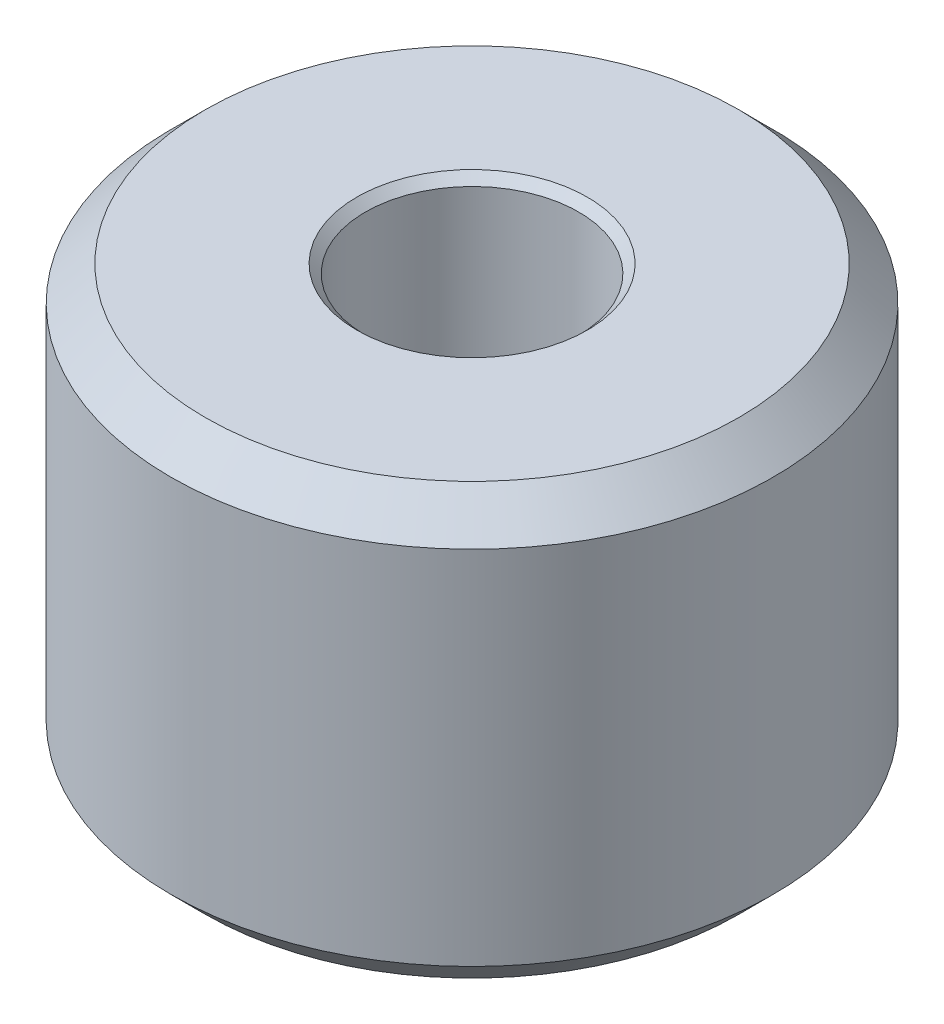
from build123d import *

# Parameters (mm, degrees)
ESQUISSE1_R             = 17.5
BOSS_EXTRU_1_DEPTH      = 25
CHANFREIN1_SIZE         = 2
ESQUISSE2_R             = 6.2
ENL_V_MAT_EXTRU_1_DEPTH = 26.7
CHANFREIN2_SIZE         = 0.5


with BuildPart() as part:
    # Esquisse1 → Boss.-Extru.1 (new body)
    with BuildSketch(Plane(origin=(0, 0, 0), x_dir=(1, 0, 0), z_dir=(0, 1, 0))):
        with Locations(Location((0, 0, 0), (0, 0, 270))):
            Circle(ESQUISSE1_R)
    extrude(amount=BOSS_EXTRU_1_DEPTH)

    # Chanfrein1
    chanfrein1_edges = [part.edges().sort_by_distance(p)[0] for p in [
        (0, 0, -17.5),
        (0, 25, -17.5),
    ]]
    chamfer(chanfrein1_edges, length=CHANFREIN1_SIZE)

    # Esquisse2 → Enl_v. mat.-Extru.1 (cut)
    with BuildSketch(Plane(origin=(0, 25, 0), x_dir=(1, 0, 0), z_dir=(0, 1, 0))):
        with Locations(Location((0, 0, 0), (0, 0, 270))):
            Circle(ESQUISSE2_R)
    extrude(amount=-ENL_V_MAT_EXTRU_1_DEPTH, mode=Mode.SUBTRACT)

    # Chanfrein2
    chanfrein2_edges = [part.edges().sort_by_distance(p)[0] for p in [
        (0, 0, -6.2),
        (0, 25, -6.2),
    ]]
    chamfer(chanfrein2_edges, length=CHANFREIN2_SIZE)


solid = part.part
